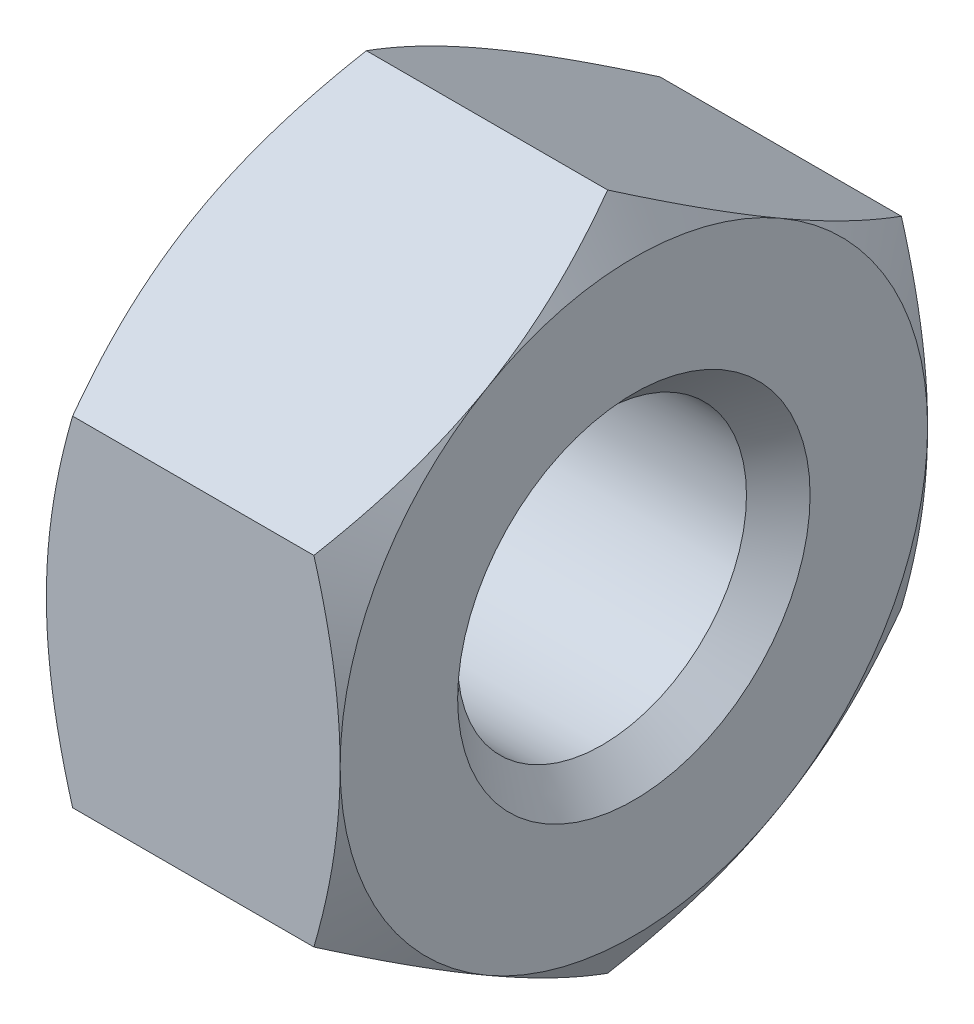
ISO-10303-21;
HEADER;
FILE_DESCRIPTION(('STEP AP214'),'2;1');
FILE_NAME('part.step','',(''),(''),'','','');
FILE_SCHEMA(('AUTOMOTIVE_DESIGN { 1 0 10303 214 1 1 1 1 }'));
ENDSEC;
DATA;
#1=APPLICATION_CONTEXT('core data for automotive mechanical design processes');
#2=APPLICATION_PROTOCOL_DEFINITION('international standard','automotive_design',2000,#1);
#3=PRODUCT_CONTEXT('',#1,'mechanical');
#4=PRODUCT('Part','Part','',(#3));
#5=PRODUCT_RELATED_PRODUCT_CATEGORY('part','',(#4));
#6=PRODUCT_DEFINITION_FORMATION('','',#4);
#7=PRODUCT_DEFINITION_CONTEXT('part definition',#1,'design');
#8=PRODUCT_DEFINITION('design','',#6,#7);
#9=PRODUCT_DEFINITION_SHAPE('','',#8);
#10=(LENGTH_UNIT() NAMED_UNIT(*) SI_UNIT(.MILLI.,.METRE.));
#11=(NAMED_UNIT(*) PLANE_ANGLE_UNIT() SI_UNIT($,.RADIAN.));
#12=(NAMED_UNIT(*) SI_UNIT($,.STERADIAN.) SOLID_ANGLE_UNIT());
#13=UNCERTAINTY_MEASURE_WITH_UNIT(LENGTH_MEASURE(1.E-05),#10,'distance_accuracy_value','');
#14=(GEOMETRIC_REPRESENTATION_CONTEXT(3) GLOBAL_UNCERTAINTY_ASSIGNED_CONTEXT((#13)) GLOBAL_UNIT_ASSIGNED_CONTEXT((#10,
#11,#12)) REPRESENTATION_CONTEXT('',''));
#15=CARTESIAN_POINT('',(0.,0.,0.));
#16=DIRECTION('',(0.,0.,1.));
#17=DIRECTION('',(1.,0.,0.));
#18=AXIS2_PLACEMENT_3D('',#15,#16,#17);
#19=CARTESIAN_POINT('',(0.577350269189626,0.,0.));
#20=DIRECTION('',(1.,0.,0.));
#21=DIRECTION('',(0.,0.,-1.));
#22=AXIS2_PLACEMENT_3D('',#19,#20,#21);
#23=CONICAL_SURFACE('',#22,6.,1.0471975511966);
#24=CARTESIAN_POINT('',(0.446648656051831,-2.88663587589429,-5.0002));
#25=CARTESIAN_POINT('',(0.373386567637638,-3.01349970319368,-4.78046540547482));
#26=CARTESIAN_POINT('',(0.306751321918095,-3.14144859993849,-4.55885141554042));
#27=CARTESIAN_POINT('',(0.190438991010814,-3.39956193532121,-4.11178600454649));
#28=CARTESIAN_POINT('',(0.140803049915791,-3.52973095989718,-3.88632664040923));
#29=CARTESIAN_POINT('',(0.0635510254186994,-3.78847564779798,-3.43816769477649));
#30=CARTESIAN_POINT('',(0.0354203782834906,-3.91701101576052,-3.21553790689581));
#31=CARTESIAN_POINT('',(0.0101949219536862,-4.11026620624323,-2.88081009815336));
#32=CARTESIAN_POINT('',(0.00461345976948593,-4.17472868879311,-2.76915780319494));
#33=CARTESIAN_POINT('',(-0.000797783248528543,-4.30371322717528,-2.5457500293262));
#34=CARTESIAN_POINT('',(-0.000627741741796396,-4.36823528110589,-2.43399455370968));
#35=CARTESIAN_POINT('',(0.0077536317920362,-4.54500768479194,-2.12781576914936));
#36=CARTESIAN_POINT('',(0.0218297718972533,-4.65719946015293,-1.93349391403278));
#37=CARTESIAN_POINT('',(0.0664652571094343,-4.88083840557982,-1.54613989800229));
#38=CARTESIAN_POINT('',(0.0970398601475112,-4.99228478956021,-1.35310909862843));
#39=CARTESIAN_POINT('',(0.173468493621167,-5.21637431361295,-0.964974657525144));
#40=CARTESIAN_POINT('',(0.219646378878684,-5.32898917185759,-0.769920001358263));
#41=CARTESIAN_POINT('',(0.324451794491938,-5.55253939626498,-0.382719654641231));
#42=CARTESIAN_POINT('',(0.383054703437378,-5.66347762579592,-0.190569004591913));
#43=CARTESIAN_POINT('',(0.446648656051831,-5.7736181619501,0.000200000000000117));
#44=B_SPLINE_CURVE_WITH_KNOTS('',3,(#24,#25,#26,#27,#28,#29,#30,#31,#32,#33,#34,#35,#36,#37,#38,
#39,#40,#41,#42,#43),.UNSPECIFIED.,.F.,.F.,(4,2,2,2,2,2,2,2,2,4),(0.,0.792555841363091,
1.58701660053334,2.36181537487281,2.74884076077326,3.13585419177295,3.8096236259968,
4.4840172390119,5.17336882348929,5.86136694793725),.UNSPECIFIED.);
#45=CARTESIAN_POINT('',(0.,-4.3301270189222,-2.5));
#46=VERTEX_POINT('',#45);
#47=CARTESIAN_POINT('',(0.446581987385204,-5.77350269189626,0.));
#48=VERTEX_POINT('',#47);
#49=EDGE_CURVE('E274',#46,#48,#44,.T.);
#50=ORIENTED_EDGE('',*,*,#49,.T.);
#51=CARTESIAN_POINT('',(0.446648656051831,-5.77361816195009,-0.0002));
#52=CARTESIAN_POINT('',(0.373386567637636,-5.6467543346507,0.219534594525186));
#53=CARTESIAN_POINT('',(0.306751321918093,-5.51880543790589,0.441148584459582));
#54=CARTESIAN_POINT('',(0.190438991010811,-5.26069210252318,0.888213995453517));
#55=CARTESIAN_POINT('',(0.140803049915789,-5.13052307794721,1.11367335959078));
#56=CARTESIAN_POINT('',(0.0635510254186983,-4.87177839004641,1.56183230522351));
#57=CARTESIAN_POINT('',(0.0354203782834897,-4.74324302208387,1.7844620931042));
#58=CARTESIAN_POINT('',(0.0101949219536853,-4.54998783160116,2.11918990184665));
#59=CARTESIAN_POINT('',(0.00461345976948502,-4.48552534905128,2.23084219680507));
#60=CARTESIAN_POINT('',(-0.000797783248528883,-4.35654081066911,2.4542499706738));
#61=CARTESIAN_POINT('',(-0.000627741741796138,-4.2920187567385,2.56600544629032));
#62=CARTESIAN_POINT('',(0.00775363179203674,-4.11524635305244,2.87218423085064));
#63=CARTESIAN_POINT('',(0.0218297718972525,-4.00305457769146,3.06650608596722));
#64=CARTESIAN_POINT('',(0.0664652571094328,-3.77941563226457,3.45386010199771));
#65=CARTESIAN_POINT('',(0.0970398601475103,-3.66796924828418,3.64689090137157));
#66=CARTESIAN_POINT('',(0.173468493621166,-3.44387972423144,4.03502534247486));
#67=CARTESIAN_POINT('',(0.219646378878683,-3.3312648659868,4.23007999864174));
#68=CARTESIAN_POINT('',(0.324451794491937,-3.1077146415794,4.61728034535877));
#69=CARTESIAN_POINT('',(0.383054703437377,-2.99677641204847,4.80943099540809));
#70=CARTESIAN_POINT('',(0.446648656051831,-2.88663587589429,5.0002));
#71=B_SPLINE_CURVE_WITH_KNOTS('',3,(#51,#52,#53,#54,#55,#56,#57,#58,#59,#60,#61,#62,#63,#64,#65,
#66,#67,#68,#69,#70),.UNSPECIFIED.,.F.,.F.,(4,2,2,2,2,2,2,2,2,4),(0.,0.792555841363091,
1.58701660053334,2.36181537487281,2.74884076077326,3.13585419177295,3.80962362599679,
4.48401723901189,5.17336882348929,5.86136694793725),.UNSPECIFIED.);
#72=CARTESIAN_POINT('',(0.,-4.3301270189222,2.5));
#73=VERTEX_POINT('',#72);
#74=EDGE_CURVE('E222',#48,#73,#71,.T.);
#75=ORIENTED_EDGE('',*,*,#74,.T.);
#76=CARTESIAN_POINT('',(0.,0.,0.));
#77=DIRECTION('',(-1.,0.,0.));
#78=DIRECTION('',(0.,0.,1.));
#79=AXIS2_PLACEMENT_3D('',#76,#77,#78);
#80=CIRCLE('',#79,5.);
#81=EDGE_CURVE('E252',#46,#73,#80,.T.);
#82=ORIENTED_EDGE('',*,*,#81,.F.);
#83=EDGE_LOOP('',(#50,#75,#82));
#84=FACE_BOUND('',#83,.T.);
#85=ADVANCED_FACE('F16',(#84),#23,.T.);
#86=CARTESIAN_POINT('',(0.,0.,5.));
#87=VERTEX_POINT('',#86);
#88=EDGE_CURVE('E25',#73,#87,#80,.T.);
#89=ORIENTED_EDGE('',*,*,#88,.F.);
#90=CARTESIAN_POINT('',(0.446581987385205,-2.88675134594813,5.));
#91=VERTEX_POINT('',#90);
#92=EDGE_CURVE('E223',#73,#91,#71,.T.);
#93=ORIENTED_EDGE('',*,*,#92,.T.);
#94=CARTESIAN_POINT('',(2.40141155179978,-7.67424266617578,5.));
#95=CARTESIAN_POINT('',(2.29611929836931,-7.45651756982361,5.));
#96=CARTESIAN_POINT('',(2.19186004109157,-7.23828398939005,5.));
#97=CARTESIAN_POINT('',(1.98599017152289,-6.80052913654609,5.));
#98=CARTESIAN_POINT('',(1.88437999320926,-6.5810076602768,5.));
#99=CARTESIAN_POINT('',(1.68386247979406,-6.13923637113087,5.));
#100=CARTESIAN_POINT('',(1.58497359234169,-5.91697815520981,5.));
#101=CARTESIAN_POINT('',(1.39135100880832,-5.47066571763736,5.));
#102=CARTESIAN_POINT('',(1.29661711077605,-5.24661158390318,5.));
#103=CARTESIAN_POINT('',(1.1095741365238,-4.78943363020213,5.));
#104=CARTESIAN_POINT('',(1.01742869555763,-4.55624248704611,5.));
#105=CARTESIAN_POINT('',(0.840307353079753,-4.08710259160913,5.));
#106=CARTESIAN_POINT('',(0.755332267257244,-3.8511535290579,5.));
#107=CARTESIAN_POINT('',(0.594841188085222,-3.37659063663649,5.));
#108=CARTESIAN_POINT('',(0.519305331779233,-3.13798359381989,5.));
#109=CARTESIAN_POINT('',(0.38016913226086,-2.65734835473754,5.));
#110=CARTESIAN_POINT('',(0.316564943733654,-2.41532128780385,5.));
#111=CARTESIAN_POINT('',(0.204730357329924,-1.92903682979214,5.));
#112=CARTESIAN_POINT('',(0.156419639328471,-1.68479826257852,5.));
#113=CARTESIAN_POINT('',(0.0779572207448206,-1.19336958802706,5.));
#114=CARTESIAN_POINT('',(0.0478039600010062,-0.946179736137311,5.));
#115=CARTESIAN_POINT('',(0.00845800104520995,-0.45327703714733,5.));
#116=CARTESIAN_POINT('',(-0.000997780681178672,-0.207585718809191,5.));
#117=CARTESIAN_POINT('',(0.00116511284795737,0.283721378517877,5.));
#118=CARTESIAN_POINT('',(0.0127843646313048,0.529337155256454,5.));
#119=CARTESIAN_POINT('',(0.0498085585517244,0.948737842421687,5.));
#120=CARTESIAN_POINT('',(0.0703212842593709,1.12297901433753,5.));
#121=CARTESIAN_POINT('',(0.120631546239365,1.47012511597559,5.));
#122=CARTESIAN_POINT('',(0.150430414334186,1.64302985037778,5.));
#123=CARTESIAN_POINT('',(0.252183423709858,2.15954369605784,5.));
#124=CARTESIAN_POINT('',(0.336473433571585,2.50074645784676,5.));
#125=CARTESIAN_POINT('',(0.481857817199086,3.01082734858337,5.));
#126=CARTESIAN_POINT('',(0.53413391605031,3.18236868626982,5.));
#127=CARTESIAN_POINT('',(0.643921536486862,3.52378385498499,5.));
#128=CARTESIAN_POINT('',(0.701433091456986,3.69365767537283,5.));
#129=CARTESIAN_POINT('',(0.820784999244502,4.03179540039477,5.));
#130=CARTESIAN_POINT('',(0.882623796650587,4.20005985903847,5.));
#131=CARTESIAN_POINT('',(1.00992212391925,4.53520796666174,5.));
#132=CARTESIAN_POINT('',(1.0753816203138,4.70209162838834,5.));
#133=CARTESIAN_POINT('',(1.22797114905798,5.08094953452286,5.));
#134=CARTESIAN_POINT('',(1.31605908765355,5.29253714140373,5.));
#135=CARTESIAN_POINT('',(1.49617433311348,5.71403334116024,5.));
#136=CARTESIAN_POINT('',(1.58820183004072,5.92394185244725,5.));
#137=CARTESIAN_POINT('',(1.77544370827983,6.34237109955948,5.));
#138=CARTESIAN_POINT('',(1.87065861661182,6.55089159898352,5.));
#139=CARTESIAN_POINT('',(2.06367410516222,6.9667341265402,5.));
#140=CARTESIAN_POINT('',(2.16147473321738,7.17405613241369,5.));
#141=CARTESIAN_POINT('',(2.45820681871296,7.79486538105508,5.));
#142=CARTESIAN_POINT('',(2.6603061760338,8.20683771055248,5.));
#143=CARTESIAN_POINT('',(3.07032550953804,9.02787503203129,5.));
#144=CARTESIAN_POINT('',(3.27824567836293,9.43693992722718,5.));
#145=CARTESIAN_POINT('',(3.5850921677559,10.0330186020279,5.));
#146=CARTESIAN_POINT('',(3.68236601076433,10.220885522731,5.));
#147=CARTESIAN_POINT('',(3.87769156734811,10.596210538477,5.));
#148=CARTESIAN_POINT('',(3.97574326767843,10.7836686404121,5.));
#149=CARTESIAN_POINT('',(4.2709190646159,11.3455237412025,5.));
#150=CARTESIAN_POINT('',(4.46905696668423,11.7193881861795,5.));
#151=CARTESIAN_POINT('',(4.86697004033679,12.4651867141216,5.));
#152=CARTESIAN_POINT('',(5.0667406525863,12.837123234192,5.));
#153=CARTESIAN_POINT('',(5.46792402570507,13.5800864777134,5.));
#154=CARTESIAN_POINT('',(5.66933670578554,13.9511132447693,5.));
#155=CARTESIAN_POINT('',(5.87136819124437,14.3218006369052,5.));
#156=B_SPLINE_CURVE_WITH_KNOTS('',3,(#94,#95,#96,#97,#98,#99,#100,#101,#102,#103,#104,#105,#106,
#107,#108,#109,#110,#111,#112,#113,#114,#115,#116,#117,#118,#119,#120,#121,#122,#123,#124,#125,
#126,#127,#128,#129,#130,#131,#132,#133,#134,#135,#136,#137,#138,#139,#140,#141,#142,#143,#144,
#145,#146,#147,#148,#149,#150,#151,#152,#153,#154,#155),.UNSPECIFIED.,.F.,.F.,(4,2,2,2,2,2,2,2,
2,2,2,2,2,2,2,2,2,2,2,2,2,2,2,2,2,2,2,2,2,2,4),(0.,0.725554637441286,1.45122739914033,
2.18098756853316,2.91071222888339,3.66283124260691,4.41503570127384,5.16562964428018,
5.91598127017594,6.66232408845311,7.40860276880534,8.14533911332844,8.8820956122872,
9.40817218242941,9.93432423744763,10.9872465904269,11.5251934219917,12.0631436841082,
12.6009015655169,13.1386544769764,13.8261771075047,14.5137329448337,15.2014030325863,
15.8890858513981,17.2656308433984,18.642221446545,19.2768896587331,19.9115470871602,
21.1809070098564,22.4474751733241,23.7139813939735),.UNSPECIFIED.);
#157=EDGE_CURVE('E232',#91,#87,#156,.T.);
#158=ORIENTED_EDGE('',*,*,#157,.T.);
#159=EDGE_LOOP('',(#89,#93,#158));
#160=FACE_BOUND('',#159,.T.);
#161=ADVANCED_FACE('F310',(#160),#23,.T.);
#162=CARTESIAN_POINT('',(0.,4.3301270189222,2.5));
#163=VERTEX_POINT('',#162);
#164=EDGE_CURVE('E11',#87,#163,#80,.T.);
#165=ORIENTED_EDGE('',*,*,#164,.F.);
#166=CARTESIAN_POINT('',(0.446581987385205,2.88675134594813,5.));
#167=VERTEX_POINT('',#166);
#168=EDGE_CURVE('E135',#87,#167,#156,.T.);
#169=ORIENTED_EDGE('',*,*,#168,.T.);
#170=CARTESIAN_POINT('',(0.446648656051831,2.88663587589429,5.0002));
#171=CARTESIAN_POINT('',(0.373386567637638,3.01349970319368,4.78046540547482));
#172=CARTESIAN_POINT('',(0.306751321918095,3.14144859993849,4.55885141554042));
#173=CARTESIAN_POINT('',(0.190438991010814,3.39956193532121,4.11178600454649));
#174=CARTESIAN_POINT('',(0.140803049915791,3.52973095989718,3.88632664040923));
#175=CARTESIAN_POINT('',(0.0635510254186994,3.78847564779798,3.43816769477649));
#176=CARTESIAN_POINT('',(0.0354203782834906,3.91701101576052,3.21553790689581));
#177=CARTESIAN_POINT('',(0.0101949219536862,4.11026620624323,2.88081009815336));
#178=CARTESIAN_POINT('',(0.00461345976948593,4.17472868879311,2.76915780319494));
#179=CARTESIAN_POINT('',(-0.000797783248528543,4.30371322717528,2.5457500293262));
#180=CARTESIAN_POINT('',(-0.000627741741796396,4.36823528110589,2.43399455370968));
#181=CARTESIAN_POINT('',(0.0077536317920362,4.54500768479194,2.12781576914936));
#182=CARTESIAN_POINT('',(0.0218297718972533,4.65719946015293,1.93349391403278));
#183=CARTESIAN_POINT('',(0.0664652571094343,4.88083840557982,1.54613989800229));
#184=CARTESIAN_POINT('',(0.0970398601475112,4.99228478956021,1.35310909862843));
#185=CARTESIAN_POINT('',(0.173468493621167,5.21637431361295,0.964974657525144));
#186=CARTESIAN_POINT('',(0.219646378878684,5.32898917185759,0.769920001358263));
#187=CARTESIAN_POINT('',(0.324451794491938,5.55253939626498,0.382719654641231));
#188=CARTESIAN_POINT('',(0.383054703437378,5.66347762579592,0.190569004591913));
#189=CARTESIAN_POINT('',(0.446648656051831,5.7736181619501,-0.000200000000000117));
#190=B_SPLINE_CURVE_WITH_KNOTS('',3,(#170,#171,#172,#173,#174,#175,#176,#177,#178,#179,#180,
#181,#182,#183,#184,#185,#186,#187,#188,#189),.UNSPECIFIED.,.F.,.F.,(4,2,2,2,2,2,2,2,2,4),(0.,
0.792555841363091,1.58701660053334,2.36181537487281,2.74884076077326,3.13585419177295,
3.8096236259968,4.4840172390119,5.17336882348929,5.86136694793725),.UNSPECIFIED.);
#191=EDGE_CURVE('E136',#167,#163,#190,.T.);
#192=ORIENTED_EDGE('',*,*,#191,.T.);
#193=EDGE_LOOP('',(#165,#169,#192));
#194=FACE_BOUND('',#193,.T.);
#195=ADVANCED_FACE('F134',(#194),#23,.T.);
#196=CARTESIAN_POINT('',(2.40141155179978,-7.67424266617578,-5.));
#197=CARTESIAN_POINT('',(2.29611929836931,-7.45651756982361,-5.));
#198=CARTESIAN_POINT('',(2.19186004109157,-7.23828398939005,-5.));
#199=CARTESIAN_POINT('',(1.98599017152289,-6.80052913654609,-5.));
#200=CARTESIAN_POINT('',(1.88437999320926,-6.5810076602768,-5.));
#201=CARTESIAN_POINT('',(1.68386247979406,-6.13923637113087,-5.));
#202=CARTESIAN_POINT('',(1.58497359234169,-5.91697815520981,-5.));
#203=CARTESIAN_POINT('',(1.39135100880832,-5.47066571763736,-5.));
#204=CARTESIAN_POINT('',(1.29661711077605,-5.24661158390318,-5.));
#205=CARTESIAN_POINT('',(1.1095741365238,-4.78943363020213,-5.));
#206=CARTESIAN_POINT('',(1.01742869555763,-4.55624248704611,-5.));
#207=CARTESIAN_POINT('',(0.840307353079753,-4.08710259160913,-5.));
#208=CARTESIAN_POINT('',(0.755332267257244,-3.8511535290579,-5.));
#209=CARTESIAN_POINT('',(0.594841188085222,-3.37659063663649,-5.));
#210=CARTESIAN_POINT('',(0.519305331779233,-3.13798359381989,-5.));
#211=CARTESIAN_POINT('',(0.38016913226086,-2.65734835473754,-5.));
#212=CARTESIAN_POINT('',(0.316564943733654,-2.41532128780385,-5.));
#213=CARTESIAN_POINT('',(0.204730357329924,-1.92903682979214,-5.));
#214=CARTESIAN_POINT('',(0.156419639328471,-1.68479826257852,-5.));
#215=CARTESIAN_POINT('',(0.0779572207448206,-1.19336958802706,-5.));
#216=CARTESIAN_POINT('',(0.0478039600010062,-0.946179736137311,-5.));
#217=CARTESIAN_POINT('',(0.00845800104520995,-0.45327703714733,-5.));
#218=CARTESIAN_POINT('',(-0.000997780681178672,-0.207585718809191,-5.));
#219=CARTESIAN_POINT('',(0.00116511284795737,0.283721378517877,-5.));
#220=CARTESIAN_POINT('',(0.0127843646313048,0.529337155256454,-5.));
#221=CARTESIAN_POINT('',(0.0498085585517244,0.948737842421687,-5.));
#222=CARTESIAN_POINT('',(0.0703212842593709,1.12297901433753,-5.));
#223=CARTESIAN_POINT('',(0.120631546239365,1.47012511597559,-5.));
#224=CARTESIAN_POINT('',(0.150430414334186,1.64302985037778,-5.));
#225=CARTESIAN_POINT('',(0.252183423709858,2.15954369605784,-5.));
#226=CARTESIAN_POINT('',(0.336473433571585,2.50074645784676,-5.));
#227=CARTESIAN_POINT('',(0.481857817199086,3.01082734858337,-5.));
#228=CARTESIAN_POINT('',(0.53413391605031,3.18236868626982,-5.));
#229=CARTESIAN_POINT('',(0.643921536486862,3.52378385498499,-5.));
#230=CARTESIAN_POINT('',(0.701433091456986,3.69365767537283,-5.));
#231=CARTESIAN_POINT('',(0.820784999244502,4.03179540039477,-5.));
#232=CARTESIAN_POINT('',(0.882623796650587,4.20005985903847,-5.));
#233=CARTESIAN_POINT('',(1.00992212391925,4.53520796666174,-5.));
#234=CARTESIAN_POINT('',(1.0753816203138,4.70209162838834,-5.));
#235=CARTESIAN_POINT('',(1.22797114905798,5.08094953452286,-5.));
#236=CARTESIAN_POINT('',(1.31605908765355,5.29253714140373,-5.));
#237=CARTESIAN_POINT('',(1.49617433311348,5.71403334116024,-5.));
#238=CARTESIAN_POINT('',(1.58820183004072,5.92394185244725,-5.));
#239=CARTESIAN_POINT('',(1.77544370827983,6.34237109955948,-5.));
#240=CARTESIAN_POINT('',(1.87065861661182,6.55089159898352,-5.));
#241=CARTESIAN_POINT('',(2.06367410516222,6.9667341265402,-5.));
#242=CARTESIAN_POINT('',(2.16147473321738,7.17405613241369,-5.));
#243=CARTESIAN_POINT('',(2.45820681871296,7.79486538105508,-5.));
#244=CARTESIAN_POINT('',(2.6603061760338,8.20683771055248,-5.));
#245=CARTESIAN_POINT('',(3.07032550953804,9.02787503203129,-5.));
#246=CARTESIAN_POINT('',(3.27824567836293,9.43693992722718,-5.));
#247=CARTESIAN_POINT('',(3.5850921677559,10.0330186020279,-5.));
#248=CARTESIAN_POINT('',(3.68236601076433,10.220885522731,-5.));
#249=CARTESIAN_POINT('',(3.87769156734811,10.596210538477,-5.));
#250=CARTESIAN_POINT('',(3.97574326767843,10.7836686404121,-5.));
#251=CARTESIAN_POINT('',(4.2709190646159,11.3455237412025,-5.));
#252=CARTESIAN_POINT('',(4.46905696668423,11.7193881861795,-5.));
#253=CARTESIAN_POINT('',(4.86697004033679,12.4651867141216,-5.));
#254=CARTESIAN_POINT('',(5.0667406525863,12.837123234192,-5.));
#255=CARTESIAN_POINT('',(5.46792402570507,13.5800864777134,-5.));
#256=CARTESIAN_POINT('',(5.66933670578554,13.9511132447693,-5.));
#257=CARTESIAN_POINT('',(5.87136819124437,14.3218006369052,-5.));
#258=B_SPLINE_CURVE_WITH_KNOTS('',3,(#196,#197,#198,#199,#200,#201,#202,#203,#204,#205,#206,
#207,#208,#209,#210,#211,#212,#213,#214,#215,#216,#217,#218,#219,#220,#221,#222,#223,#224,#225,
#226,#227,#228,#229,#230,#231,#232,#233,#234,#235,#236,#237,#238,#239,#240,#241,#242,#243,#244,
#245,#246,#247,#248,#249,#250,#251,#252,#253,#254,#255,#256,#257),.UNSPECIFIED.,.F.,.F.,(4,2,2,
2,2,2,2,2,2,2,2,2,2,2,2,2,2,2,2,2,2,2,2,2,2,2,2,2,2,2,4),(0.,0.725554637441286,1.45122739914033,
2.18098756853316,2.91071222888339,3.66283124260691,4.41503570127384,5.16562964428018,
5.91598127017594,6.66232408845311,7.40860276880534,8.14533911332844,8.8820956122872,
9.40817218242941,9.93432423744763,10.9872465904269,11.5251934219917,12.0631436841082,
12.6009015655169,13.1386544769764,13.8261771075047,14.5137329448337,15.2014030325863,
15.8890858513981,17.2656308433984,18.642221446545,19.2768896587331,19.9115470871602,
21.1809070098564,22.4474751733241,23.7139813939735),.UNSPECIFIED.);
#259=CARTESIAN_POINT('',(0.,0.,-5.));
#260=VERTEX_POINT('',#259);
#261=CARTESIAN_POINT('',(0.446581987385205,-2.88675134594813,-5.));
#262=VERTEX_POINT('',#261);
#263=EDGE_CURVE('E277',#260,#262,#258,.F.);
#264=ORIENTED_EDGE('',*,*,#263,.T.);
#265=EDGE_CURVE('E276',#262,#46,#44,.T.);
#266=ORIENTED_EDGE('',*,*,#265,.T.);
#267=EDGE_CURVE('E126',#260,#46,#80,.T.);
#268=ORIENTED_EDGE('',*,*,#267,.F.);
#269=EDGE_LOOP('',(#264,#266,#268));
#270=FACE_BOUND('',#269,.T.);
#271=ADVANCED_FACE('F324',(#270),#23,.T.);
#272=CARTESIAN_POINT('',(0.,4.3301270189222,-2.5));
#273=VERTEX_POINT('',#272);
#274=EDGE_CURVE('E24',#163,#273,#80,.T.);
#275=ORIENTED_EDGE('',*,*,#274,.F.);
#276=CARTESIAN_POINT('',(0.446581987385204,5.77350269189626,0.));
#277=VERTEX_POINT('',#276);
#278=EDGE_CURVE('E117',#163,#277,#190,.T.);
#279=ORIENTED_EDGE('',*,*,#278,.T.);
#280=CARTESIAN_POINT('',(0.446648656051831,5.77361816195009,0.0002));
#281=CARTESIAN_POINT('',(0.373386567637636,5.6467543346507,-0.219534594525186));
#282=CARTESIAN_POINT('',(0.306751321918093,5.51880543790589,-0.441148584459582));
#283=CARTESIAN_POINT('',(0.190438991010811,5.26069210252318,-0.888213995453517));
#284=CARTESIAN_POINT('',(0.140803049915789,5.13052307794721,-1.11367335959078));
#285=CARTESIAN_POINT('',(0.0635510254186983,4.87177839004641,-1.56183230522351));
#286=CARTESIAN_POINT('',(0.0354203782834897,4.74324302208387,-1.7844620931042));
#287=CARTESIAN_POINT('',(0.0101949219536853,4.54998783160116,-2.11918990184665));
#288=CARTESIAN_POINT('',(0.00461345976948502,4.48552534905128,-2.23084219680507));
#289=CARTESIAN_POINT('',(-0.000797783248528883,4.35654081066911,-2.4542499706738));
#290=CARTESIAN_POINT('',(-0.000627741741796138,4.2920187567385,-2.56600544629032));
#291=CARTESIAN_POINT('',(0.00775363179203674,4.11524635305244,-2.87218423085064));
#292=CARTESIAN_POINT('',(0.0218297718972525,4.00305457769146,-3.06650608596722));
#293=CARTESIAN_POINT('',(0.0664652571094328,3.77941563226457,-3.45386010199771));
#294=CARTESIAN_POINT('',(0.0970398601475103,3.66796924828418,-3.64689090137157));
#295=CARTESIAN_POINT('',(0.173468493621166,3.44387972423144,-4.03502534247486));
#296=CARTESIAN_POINT('',(0.219646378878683,3.3312648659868,-4.23007999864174));
#297=CARTESIAN_POINT('',(0.324451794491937,3.1077146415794,-4.61728034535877));
#298=CARTESIAN_POINT('',(0.383054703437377,2.99677641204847,-4.80943099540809));
#299=CARTESIAN_POINT('',(0.446648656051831,2.88663587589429,-5.0002));
#300=B_SPLINE_CURVE_WITH_KNOTS('',3,(#280,#281,#282,#283,#284,#285,#286,#287,#288,#289,#290,
#291,#292,#293,#294,#295,#296,#297,#298,#299),.UNSPECIFIED.,.F.,.F.,(4,2,2,2,2,2,2,2,2,4),(0.,
0.792555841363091,1.58701660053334,2.36181537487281,2.74884076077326,3.13585419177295,
3.80962362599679,4.48401723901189,5.17336882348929,5.86136694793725),.UNSPECIFIED.);
#301=EDGE_CURVE('E106',#277,#273,#300,.T.);
#302=ORIENTED_EDGE('',*,*,#301,.T.);
#303=EDGE_LOOP('',(#275,#279,#302));
#304=FACE_BOUND('',#303,.T.);
#305=ADVANCED_FACE('F115',(#304),#23,.T.);
#306=CARTESIAN_POINT('',(0.,0.,0.));
#307=DIRECTION('',(1.,0.,0.));
#308=DIRECTION('',(0.,0.,-1.));
#309=AXIS2_PLACEMENT_3D('',#306,#307,#308);
#310=PLANE('',#309);
#311=CARTESIAN_POINT('',(0.,0.,0.));
#312=DIRECTION('',(-1.,0.,0.));
#313=DIRECTION('',(0.,0.,1.));
#314=AXIS2_PLACEMENT_3D('',#311,#312,#313);
#315=CIRCLE('',#314,3.);
#316=CARTESIAN_POINT('',(0.,0.,3.));
#317=VERTEX_POINT('',#316);
#318=EDGE_CURVE('E401',#317,#317,#315,.T.);
#319=ORIENTED_EDGE('',*,*,#318,.F.);
#320=EDGE_LOOP('',(#319));
#321=FACE_BOUND('',#320,.T.);
#322=ORIENTED_EDGE('',*,*,#164,.T.);
#323=ORIENTED_EDGE('',*,*,#274,.T.);
#324=EDGE_CURVE('E120',#273,#260,#80,.T.);
#325=ORIENTED_EDGE('',*,*,#324,.T.);
#326=ORIENTED_EDGE('',*,*,#267,.T.);
#327=ORIENTED_EDGE('',*,*,#81,.T.);
#328=ORIENTED_EDGE('',*,*,#88,.T.);
#329=EDGE_LOOP('',(#322,#323,#325,#326,#327,#328));
#330=FACE_BOUND('',#329,.T.);
#331=ADVANCED_FACE('F18',(#321,#330),#310,.F.);
#332=CARTESIAN_POINT('',(0.446581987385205,2.88675134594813,-5.));
#333=VERTEX_POINT('',#332);
#334=EDGE_CURVE('E103',#273,#333,#300,.T.);
#335=ORIENTED_EDGE('',*,*,#334,.T.);
#336=EDGE_CURVE('E122',#333,#260,#258,.F.);
#337=ORIENTED_EDGE('',*,*,#336,.T.);
#338=ORIENTED_EDGE('',*,*,#324,.F.);
#339=EDGE_LOOP('',(#335,#337,#338));
#340=FACE_BOUND('',#339,.T.);
#341=ADVANCED_FACE('F121',(#340),#23,.T.);
#342=CARTESIAN_POINT('',(10.,5.77350269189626,0.));
#343=DIRECTION('',(0.,-0.866025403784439,-0.5));
#344=DIRECTION('',(0.,0.5,-0.866025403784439));
#345=AXIS2_PLACEMENT_3D('',#342,#343,#344);
#346=PLANE('',#345);
#347=DIRECTION('',(-1.,0.,0.));
#348=VECTOR('',#347,1.);
#349=CARTESIAN_POINT('',(10.,2.88675134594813,5.));
#350=LINE('',#349,#348);
#351=CARTESIAN_POINT('',(4.5534180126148,2.88675134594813,5.));
#352=VERTEX_POINT('',#351);
#353=EDGE_CURVE('E347',#352,#167,#350,.T.);
#354=ORIENTED_EDGE('',*,*,#353,.F.);
#355=CARTESIAN_POINT('',(4.55335134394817,5.7736181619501,-0.0002));
#356=CARTESIAN_POINT('',(4.62661343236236,5.64675433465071,0.219534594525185));
#357=CARTESIAN_POINT('',(4.69324867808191,5.5188054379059,0.441148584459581));
#358=CARTESIAN_POINT('',(4.80956100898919,5.26069210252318,0.888213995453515));
#359=CARTESIAN_POINT('',(4.85919695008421,5.13052307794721,1.11367335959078));
#360=CARTESIAN_POINT('',(4.9364489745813,4.87177839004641,1.56183230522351));
#361=CARTESIAN_POINT('',(4.96457962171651,4.74324302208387,1.7844620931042));
#362=CARTESIAN_POINT('',(4.98980507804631,4.54998783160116,2.11918990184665));
#363=CARTESIAN_POINT('',(4.99538654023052,4.48552534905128,2.23084219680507));
#364=CARTESIAN_POINT('',(5.00079778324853,4.35654081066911,2.4542499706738));
#365=CARTESIAN_POINT('',(5.0006277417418,4.2920187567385,2.56600544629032));
#366=CARTESIAN_POINT('',(4.99224636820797,4.11524635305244,2.87218423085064));
#367=CARTESIAN_POINT('',(4.97817022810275,4.00305457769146,3.06650608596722));
#368=CARTESIAN_POINT('',(4.93353474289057,3.77941563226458,3.45386010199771));
#369=CARTESIAN_POINT('',(4.90296013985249,3.66796924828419,3.64689090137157));
#370=CARTESIAN_POINT('',(4.82653150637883,3.44387972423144,4.03502534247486));
#371=CARTESIAN_POINT('',(4.78035362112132,3.3312648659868,4.23007999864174));
#372=CARTESIAN_POINT('',(4.67554820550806,3.10771464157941,4.61728034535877));
#373=CARTESIAN_POINT('',(4.61694529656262,2.99677641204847,4.80943099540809));
#374=CARTESIAN_POINT('',(4.55335134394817,2.88663587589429,5.0002));
#375=B_SPLINE_CURVE_WITH_KNOTS('',3,(#355,#356,#357,#358,#359,#360,#361,#362,#363,#364,#365,
#366,#367,#368,#369,#370,#371,#372,#373,#374),.UNSPECIFIED.,.F.,.F.,(4,2,2,2,2,2,2,2,2,4),(0.,
0.792555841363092,1.58701660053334,2.36181537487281,2.74884076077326,3.13585419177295,
3.8096236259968,4.48401723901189,5.17336882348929,5.86136694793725),.UNSPECIFIED.);
#376=CARTESIAN_POINT('',(5.,4.3301270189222,2.5));
#377=VERTEX_POINT('',#376);
#378=EDGE_CURVE('E152',#377,#352,#375,.T.);
#379=ORIENTED_EDGE('',*,*,#378,.F.);
#380=CARTESIAN_POINT('',(4.5534180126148,5.77350269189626,0.));
#381=VERTEX_POINT('',#380);
#382=EDGE_CURVE('E145',#381,#377,#375,.T.);
#383=ORIENTED_EDGE('',*,*,#382,.F.);
#384=DIRECTION('',(-1.,0.,0.));
#385=VECTOR('',#384,1.);
#386=CARTESIAN_POINT('',(10.,5.77350269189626,0.));
#387=LINE('',#386,#385);
#388=EDGE_CURVE('E39',#381,#277,#387,.T.);
#389=ORIENTED_EDGE('',*,*,#388,.T.);
#390=ORIENTED_EDGE('',*,*,#278,.F.);
#391=ORIENTED_EDGE('',*,*,#191,.F.);
#392=EDGE_LOOP('',(#354,#379,#383,#389,#390,#391));
#393=FACE_BOUND('',#392,.T.);
#394=ADVANCED_FACE('F160',(#393),#346,.F.);
#395=CARTESIAN_POINT('',(10.,2.88675134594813,5.));
#396=DIRECTION('',(0.,0.,-1.));
#397=DIRECTION('',(-1.,0.,0.));
#398=AXIS2_PLACEMENT_3D('',#395,#396,#397);
#399=PLANE('',#398);
#400=DIRECTION('',(-1.,0.,0.));
#401=VECTOR('',#400,1.);
#402=CARTESIAN_POINT('',(10.,-2.88675134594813,5.));
#403=LINE('',#402,#401);
#404=CARTESIAN_POINT('',(4.5534180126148,-2.88675134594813,5.));
#405=VERTEX_POINT('',#404);
#406=EDGE_CURVE('E341',#405,#91,#403,.T.);
#407=ORIENTED_EDGE('',*,*,#406,.F.);
#408=CARTESIAN_POINT('',(2.59858844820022,-7.67424266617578,5.));
#409=CARTESIAN_POINT('',(2.7038807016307,-7.4565175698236,5.));
#410=CARTESIAN_POINT('',(2.80813995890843,-7.23828398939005,5.));
#411=CARTESIAN_POINT('',(3.01400982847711,-6.80052913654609,5.));
#412=CARTESIAN_POINT('',(3.11562000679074,-6.5810076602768,5.));
#413=CARTESIAN_POINT('',(3.31613752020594,-6.13923637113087,5.));
#414=CARTESIAN_POINT('',(3.41502640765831,-5.91697815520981,5.));
#415=CARTESIAN_POINT('',(3.60864899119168,-5.47066571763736,5.));
#416=CARTESIAN_POINT('',(3.70338288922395,-5.24661158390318,5.));
#417=CARTESIAN_POINT('',(3.8904258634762,-4.78943363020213,5.));
#418=CARTESIAN_POINT('',(3.98257130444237,-4.55624248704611,5.));
#419=CARTESIAN_POINT('',(4.15969264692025,-4.08710259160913,5.));
#420=CARTESIAN_POINT('',(4.24466773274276,-3.8511535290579,5.));
#421=CARTESIAN_POINT('',(4.40515881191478,-3.37659063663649,5.));
#422=CARTESIAN_POINT('',(4.48069466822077,-3.13798359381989,5.));
#423=CARTESIAN_POINT('',(4.61983086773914,-2.65734835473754,5.));
#424=CARTESIAN_POINT('',(4.68343505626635,-2.41532128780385,5.));
#425=CARTESIAN_POINT('',(4.79526964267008,-1.92903682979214,5.));
#426=CARTESIAN_POINT('',(4.84358036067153,-1.68479826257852,5.));
#427=CARTESIAN_POINT('',(4.92204277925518,-1.19336958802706,5.));
#428=CARTESIAN_POINT('',(4.95219603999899,-0.946179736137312,5.));
#429=CARTESIAN_POINT('',(4.99154199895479,-0.45327703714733,5.));
#430=CARTESIAN_POINT('',(5.00099778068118,-0.207585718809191,5.));
#431=CARTESIAN_POINT('',(4.99883488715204,0.283721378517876,5.));
#432=CARTESIAN_POINT('',(4.98721563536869,0.529337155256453,5.));
#433=CARTESIAN_POINT('',(4.95019144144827,0.948737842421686,5.));
#434=CARTESIAN_POINT('',(4.92967871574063,1.12297901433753,5.));
#435=CARTESIAN_POINT('',(4.87936845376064,1.47012511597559,5.));
#436=CARTESIAN_POINT('',(4.84956958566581,1.64302985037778,5.));
#437=CARTESIAN_POINT('',(4.74781657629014,2.15954369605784,5.));
#438=CARTESIAN_POINT('',(4.66352656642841,2.50074645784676,5.));
#439=CARTESIAN_POINT('',(4.51814218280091,3.01082734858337,5.));
#440=CARTESIAN_POINT('',(4.46586608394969,3.18236868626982,5.));
#441=CARTESIAN_POINT('',(4.35607846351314,3.52378385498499,5.));
#442=CARTESIAN_POINT('',(4.29856690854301,3.69365767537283,5.));
#443=CARTESIAN_POINT('',(4.1792150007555,4.03179540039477,5.));
#444=CARTESIAN_POINT('',(4.11737620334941,4.20005985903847,5.));
#445=CARTESIAN_POINT('',(3.99007787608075,4.53520796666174,5.));
#446=CARTESIAN_POINT('',(3.9246183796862,4.70209162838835,5.));
#447=CARTESIAN_POINT('',(3.77202885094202,5.08094953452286,5.));
#448=CARTESIAN_POINT('',(3.68394091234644,5.29253714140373,5.));
#449=CARTESIAN_POINT('',(3.50382566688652,5.71403334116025,5.));
#450=CARTESIAN_POINT('',(3.41179816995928,5.92394185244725,5.));
#451=CARTESIAN_POINT('',(3.22455629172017,6.34237109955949,5.));
#452=CARTESIAN_POINT('',(3.12934138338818,6.55089159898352,5.));
#453=CARTESIAN_POINT('',(2.93632589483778,6.96673412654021,5.));
#454=CARTESIAN_POINT('',(2.83852526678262,7.1740561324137,5.));
#455=CARTESIAN_POINT('',(2.54179318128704,7.79486538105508,5.));
#456=CARTESIAN_POINT('',(2.3396938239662,8.20683771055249,5.));
#457=CARTESIAN_POINT('',(1.92967449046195,9.02787503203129,5.));
#458=CARTESIAN_POINT('',(1.72175432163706,9.43693992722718,5.));
#459=CARTESIAN_POINT('',(1.4149078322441,10.033018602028,5.));
#460=CARTESIAN_POINT('',(1.31763398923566,10.220885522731,5.));
#461=CARTESIAN_POINT('',(1.12230843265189,10.596210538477,5.));
#462=CARTESIAN_POINT('',(1.02425673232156,10.7836686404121,5.));
#463=CARTESIAN_POINT('',(0.729080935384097,11.3455237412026,5.));
#464=CARTESIAN_POINT('',(0.530943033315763,11.7193881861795,5.));
#465=CARTESIAN_POINT('',(0.133029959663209,12.4651867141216,5.));
#466=CARTESIAN_POINT('',(-0.0667406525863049,12.837123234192,5.));
#467=CARTESIAN_POINT('',(-0.46792402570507,13.5800864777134,5.));
#468=CARTESIAN_POINT('',(-0.669336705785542,13.9511132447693,5.));
#469=CARTESIAN_POINT('',(-0.871368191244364,14.3218006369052,5.));
#470=B_SPLINE_CURVE_WITH_KNOTS('',3,(#408,#409,#410,#411,#412,#413,#414,#415,#416,#417,#418,
#419,#420,#421,#422,#423,#424,#425,#426,#427,#428,#429,#430,#431,#432,#433,#434,#435,#436,#437,
#438,#439,#440,#441,#442,#443,#444,#445,#446,#447,#448,#449,#450,#451,#452,#453,#454,#455,#456,
#457,#458,#459,#460,#461,#462,#463,#464,#465,#466,#467,#468,#469),.UNSPECIFIED.,.F.,.F.,(4,2,2,
2,2,2,2,2,2,2,2,2,2,2,2,2,2,2,2,2,2,2,2,2,2,2,2,2,2,2,4),(0.,0.725554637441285,1.45122739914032,
2.18098756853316,2.91071222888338,3.6628312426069,4.41503570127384,5.16562964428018,
5.91598127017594,6.66232408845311,7.40860276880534,8.14533911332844,8.88209561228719,
9.40817218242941,9.93432423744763,10.9872465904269,11.5251934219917,12.0631436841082,
12.6009015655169,13.1386544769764,13.8261771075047,14.5137329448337,15.2014030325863,
15.8890858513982,17.2656308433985,18.642221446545,19.2768896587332,19.9115470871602,
21.1809070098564,22.4474751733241,23.7139813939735),.UNSPECIFIED.);
#471=CARTESIAN_POINT('',(5.,0.,5.));
#472=VERTEX_POINT('',#471);
#473=EDGE_CURVE('E215',#472,#405,#470,.F.);
#474=ORIENTED_EDGE('',*,*,#473,.F.);
#475=EDGE_CURVE('E221',#352,#472,#470,.F.);
#476=ORIENTED_EDGE('',*,*,#475,.F.);
#477=ORIENTED_EDGE('',*,*,#353,.T.);
#478=ORIENTED_EDGE('',*,*,#168,.F.);
#479=ORIENTED_EDGE('',*,*,#157,.F.);
#480=EDGE_LOOP('',(#407,#474,#476,#477,#478,#479));
#481=FACE_BOUND('',#480,.T.);
#482=ADVANCED_FACE('F165',(#481),#399,.F.);
#483=CARTESIAN_POINT('',(10.,-2.88675134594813,5.));
#484=DIRECTION('',(0.,0.866025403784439,-0.5));
#485=DIRECTION('',(0.,0.5,0.866025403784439));
#486=AXIS2_PLACEMENT_3D('',#483,#484,#485);
#487=PLANE('',#486);
#488=DIRECTION('',(-1.,0.,0.));
#489=VECTOR('',#488,1.);
#490=CARTESIAN_POINT('',(10.,-5.77350269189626,0.));
#491=LINE('',#490,#489);
#492=CARTESIAN_POINT('',(4.5534180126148,-5.77350269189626,0.));
#493=VERTEX_POINT('',#492);
#494=EDGE_CURVE('E339',#493,#48,#491,.T.);
#495=ORIENTED_EDGE('',*,*,#494,.F.);
#496=CARTESIAN_POINT('',(4.55335134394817,-2.88663587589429,5.0002));
#497=CARTESIAN_POINT('',(4.62661343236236,-3.01349970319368,4.78046540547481));
#498=CARTESIAN_POINT('',(4.69324867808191,-3.14144859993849,4.55885141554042));
#499=CARTESIAN_POINT('',(4.80956100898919,-3.39956193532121,4.11178600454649));
#500=CARTESIAN_POINT('',(4.85919695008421,-3.52973095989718,3.88632664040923));
#501=CARTESIAN_POINT('',(4.9364489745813,-3.78847564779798,3.43816769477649));
#502=CARTESIAN_POINT('',(4.96457962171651,-3.91701101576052,3.2155379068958));
#503=CARTESIAN_POINT('',(4.98980507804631,-4.11026620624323,2.88081009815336));
#504=CARTESIAN_POINT('',(4.99538654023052,-4.17472868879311,2.76915780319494));
#505=CARTESIAN_POINT('',(5.00079778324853,-4.30371322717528,2.5457500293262));
#506=CARTESIAN_POINT('',(5.0006277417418,-4.36823528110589,2.43399455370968));
#507=CARTESIAN_POINT('',(4.99224636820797,-4.54500768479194,2.12781576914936));
#508=CARTESIAN_POINT('',(4.97817022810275,-4.65719946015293,1.93349391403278));
#509=CARTESIAN_POINT('',(4.93353474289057,-4.88083840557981,1.54613989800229));
#510=CARTESIAN_POINT('',(4.90296013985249,-4.9922847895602,1.35310909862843));
#511=CARTESIAN_POINT('',(4.82653150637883,-5.21637431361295,0.964974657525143));
#512=CARTESIAN_POINT('',(4.78035362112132,-5.32898917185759,0.769920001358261));
#513=CARTESIAN_POINT('',(4.67554820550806,-5.55253939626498,0.382719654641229));
#514=CARTESIAN_POINT('',(4.61694529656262,-5.66347762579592,0.190569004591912));
#515=CARTESIAN_POINT('',(4.55335134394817,-5.7736181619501,-0.000200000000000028));
#516=B_SPLINE_CURVE_WITH_KNOTS('',3,(#496,#497,#498,#499,#500,#501,#502,#503,#504,#505,#506,
#507,#508,#509,#510,#511,#512,#513,#514,#515),.UNSPECIFIED.,.F.,.F.,(4,2,2,2,2,2,2,2,2,4),(0.,
0.792555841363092,1.58701660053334,2.36181537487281,2.74884076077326,3.13585419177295,
3.8096236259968,4.4840172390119,5.17336882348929,5.86136694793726),.UNSPECIFIED.);
#517=CARTESIAN_POINT('',(5.,-4.3301270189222,2.5));
#518=VERTEX_POINT('',#517);
#519=EDGE_CURVE('E208',#518,#493,#516,.T.);
#520=ORIENTED_EDGE('',*,*,#519,.F.);
#521=EDGE_CURVE('E244',#405,#518,#516,.T.);
#522=ORIENTED_EDGE('',*,*,#521,.F.);
#523=ORIENTED_EDGE('',*,*,#406,.T.);
#524=ORIENTED_EDGE('',*,*,#92,.F.);
#525=ORIENTED_EDGE('',*,*,#74,.F.);
#526=EDGE_LOOP('',(#495,#520,#522,#523,#524,#525));
#527=FACE_BOUND('',#526,.T.);
#528=ADVANCED_FACE('F294',(#527),#487,.F.);
#529=CARTESIAN_POINT('',(10.,-5.77350269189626,0.));
#530=DIRECTION('',(0.,0.866025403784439,0.5));
#531=DIRECTION('',(0.,-0.5,0.866025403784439));
#532=AXIS2_PLACEMENT_3D('',#529,#530,#531);
#533=PLANE('',#532);
#534=DIRECTION('',(-1.,0.,0.));
#535=VECTOR('',#534,1.);
#536=CARTESIAN_POINT('',(10.,-2.88675134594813,-5.));
#537=LINE('',#536,#535);
#538=CARTESIAN_POINT('',(4.5534180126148,-2.88675134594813,-5.));
#539=VERTEX_POINT('',#538);
#540=EDGE_CURVE('E338',#539,#262,#537,.T.);
#541=ORIENTED_EDGE('',*,*,#540,.F.);
#542=CARTESIAN_POINT('',(4.55335134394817,-5.7736181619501,0.0002));
#543=CARTESIAN_POINT('',(4.62661343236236,-5.64675433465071,-0.219534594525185));
#544=CARTESIAN_POINT('',(4.69324867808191,-5.5188054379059,-0.441148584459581));
#545=CARTESIAN_POINT('',(4.80956100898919,-5.26069210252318,-0.888213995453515));
#546=CARTESIAN_POINT('',(4.85919695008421,-5.13052307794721,-1.11367335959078));
#547=CARTESIAN_POINT('',(4.9364489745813,-4.87177839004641,-1.56183230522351));
#548=CARTESIAN_POINT('',(4.96457962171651,-4.74324302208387,-1.7844620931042));
#549=CARTESIAN_POINT('',(4.98980507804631,-4.54998783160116,-2.11918990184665));
#550=CARTESIAN_POINT('',(4.99538654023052,-4.48552534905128,-2.23084219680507));
#551=CARTESIAN_POINT('',(5.00079778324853,-4.35654081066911,-2.4542499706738));
#552=CARTESIAN_POINT('',(5.0006277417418,-4.2920187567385,-2.56600544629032));
#553=CARTESIAN_POINT('',(4.99224636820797,-4.11524635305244,-2.87218423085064));
#554=CARTESIAN_POINT('',(4.97817022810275,-4.00305457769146,-3.06650608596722));
#555=CARTESIAN_POINT('',(4.93353474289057,-3.77941563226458,-3.45386010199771));
#556=CARTESIAN_POINT('',(4.90296013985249,-3.66796924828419,-3.64689090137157));
#557=CARTESIAN_POINT('',(4.82653150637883,-3.44387972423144,-4.03502534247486));
#558=CARTESIAN_POINT('',(4.78035362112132,-3.3312648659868,-4.23007999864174));
#559=CARTESIAN_POINT('',(4.67554820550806,-3.10771464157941,-4.61728034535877));
#560=CARTESIAN_POINT('',(4.61694529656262,-2.99677641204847,-4.80943099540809));
#561=CARTESIAN_POINT('',(4.55335134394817,-2.88663587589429,-5.0002));
#562=B_SPLINE_CURVE_WITH_KNOTS('',3,(#542,#543,#544,#545,#546,#547,#548,#549,#550,#551,#552,
#553,#554,#555,#556,#557,#558,#559,#560,#561),.UNSPECIFIED.,.F.,.F.,(4,2,2,2,2,2,2,2,2,4),(0.,
0.792555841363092,1.58701660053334,2.36181537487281,2.74884076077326,3.13585419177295,
3.8096236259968,4.48401723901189,5.17336882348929,5.86136694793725),.UNSPECIFIED.);
#563=CARTESIAN_POINT('',(5.,-4.3301270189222,-2.5));
#564=VERTEX_POINT('',#563);
#565=EDGE_CURVE('E200',#564,#539,#562,.T.);
#566=ORIENTED_EDGE('',*,*,#565,.F.);
#567=EDGE_CURVE('E270',#493,#564,#562,.T.);
#568=ORIENTED_EDGE('',*,*,#567,.F.);
#569=ORIENTED_EDGE('',*,*,#494,.T.);
#570=ORIENTED_EDGE('',*,*,#49,.F.);
#571=ORIENTED_EDGE('',*,*,#265,.F.);
#572=EDGE_LOOP('',(#541,#566,#568,#569,#570,#571));
#573=FACE_BOUND('',#572,.T.);
#574=ADVANCED_FACE('F287',(#573),#533,.F.);
#575=CARTESIAN_POINT('',(10.,-2.88675134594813,-5.));
#576=DIRECTION('',(0.,0.,1.));
#577=DIRECTION('',(1.,0.,0.));
#578=AXIS2_PLACEMENT_3D('',#575,#576,#577);
#579=PLANE('',#578);
#580=DIRECTION('',(-1.,0.,0.));
#581=VECTOR('',#580,1.);
#582=CARTESIAN_POINT('',(10.,2.88675134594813,-5.));
#583=LINE('',#582,#581);
#584=CARTESIAN_POINT('',(4.5534180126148,2.88675134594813,-5.));
#585=VERTEX_POINT('',#584);
#586=EDGE_CURVE('E32',#585,#333,#583,.T.);
#587=ORIENTED_EDGE('',*,*,#586,.F.);
#588=CARTESIAN_POINT('',(2.59858844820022,-7.67424266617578,-5.));
#589=CARTESIAN_POINT('',(2.7038807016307,-7.4565175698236,-5.));
#590=CARTESIAN_POINT('',(2.80813995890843,-7.23828398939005,-5.));
#591=CARTESIAN_POINT('',(3.01400982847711,-6.80052913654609,-5.));
#592=CARTESIAN_POINT('',(3.11562000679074,-6.5810076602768,-5.));
#593=CARTESIAN_POINT('',(3.31613752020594,-6.13923637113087,-5.));
#594=CARTESIAN_POINT('',(3.41502640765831,-5.91697815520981,-5.));
#595=CARTESIAN_POINT('',(3.60864899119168,-5.47066571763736,-5.));
#596=CARTESIAN_POINT('',(3.70338288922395,-5.24661158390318,-5.));
#597=CARTESIAN_POINT('',(3.8904258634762,-4.78943363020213,-5.));
#598=CARTESIAN_POINT('',(3.98257130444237,-4.55624248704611,-5.));
#599=CARTESIAN_POINT('',(4.15969264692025,-4.08710259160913,-5.));
#600=CARTESIAN_POINT('',(4.24466773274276,-3.8511535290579,-5.));
#601=CARTESIAN_POINT('',(4.40515881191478,-3.37659063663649,-5.));
#602=CARTESIAN_POINT('',(4.48069466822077,-3.13798359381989,-5.));
#603=CARTESIAN_POINT('',(4.61983086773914,-2.65734835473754,-5.));
#604=CARTESIAN_POINT('',(4.68343505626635,-2.41532128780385,-5.));
#605=CARTESIAN_POINT('',(4.79526964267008,-1.92903682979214,-5.));
#606=CARTESIAN_POINT('',(4.84358036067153,-1.68479826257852,-5.));
#607=CARTESIAN_POINT('',(4.92204277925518,-1.19336958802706,-5.));
#608=CARTESIAN_POINT('',(4.95219603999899,-0.946179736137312,-5.));
#609=CARTESIAN_POINT('',(4.99154199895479,-0.45327703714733,-5.));
#610=CARTESIAN_POINT('',(5.00099778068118,-0.207585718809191,-5.));
#611=CARTESIAN_POINT('',(4.99883488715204,0.283721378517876,-5.));
#612=CARTESIAN_POINT('',(4.98721563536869,0.529337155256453,-5.));
#613=CARTESIAN_POINT('',(4.95019144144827,0.948737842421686,-5.));
#614=CARTESIAN_POINT('',(4.92967871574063,1.12297901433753,-5.));
#615=CARTESIAN_POINT('',(4.87936845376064,1.47012511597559,-5.));
#616=CARTESIAN_POINT('',(4.84956958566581,1.64302985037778,-5.));
#617=CARTESIAN_POINT('',(4.74781657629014,2.15954369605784,-5.));
#618=CARTESIAN_POINT('',(4.66352656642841,2.50074645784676,-5.));
#619=CARTESIAN_POINT('',(4.51814218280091,3.01082734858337,-5.));
#620=CARTESIAN_POINT('',(4.46586608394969,3.18236868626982,-5.));
#621=CARTESIAN_POINT('',(4.35607846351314,3.52378385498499,-5.));
#622=CARTESIAN_POINT('',(4.29856690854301,3.69365767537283,-5.));
#623=CARTESIAN_POINT('',(4.1792150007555,4.03179540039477,-5.));
#624=CARTESIAN_POINT('',(4.11737620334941,4.20005985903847,-5.));
#625=CARTESIAN_POINT('',(3.99007787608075,4.53520796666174,-5.));
#626=CARTESIAN_POINT('',(3.9246183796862,4.70209162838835,-5.));
#627=CARTESIAN_POINT('',(3.77202885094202,5.08094953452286,-5.));
#628=CARTESIAN_POINT('',(3.68394091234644,5.29253714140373,-5.));
#629=CARTESIAN_POINT('',(3.50382566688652,5.71403334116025,-5.));
#630=CARTESIAN_POINT('',(3.41179816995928,5.92394185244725,-5.));
#631=CARTESIAN_POINT('',(3.22455629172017,6.34237109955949,-5.));
#632=CARTESIAN_POINT('',(3.12934138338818,6.55089159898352,-5.));
#633=CARTESIAN_POINT('',(2.93632589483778,6.96673412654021,-5.));
#634=CARTESIAN_POINT('',(2.83852526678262,7.1740561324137,-5.));
#635=CARTESIAN_POINT('',(2.54179318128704,7.79486538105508,-5.));
#636=CARTESIAN_POINT('',(2.3396938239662,8.20683771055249,-5.));
#637=CARTESIAN_POINT('',(1.92967449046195,9.02787503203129,-5.));
#638=CARTESIAN_POINT('',(1.72175432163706,9.43693992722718,-5.));
#639=CARTESIAN_POINT('',(1.4149078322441,10.033018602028,-5.));
#640=CARTESIAN_POINT('',(1.31763398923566,10.220885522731,-5.));
#641=CARTESIAN_POINT('',(1.12230843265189,10.596210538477,-5.));
#642=CARTESIAN_POINT('',(1.02425673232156,10.7836686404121,-5.));
#643=CARTESIAN_POINT('',(0.729080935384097,11.3455237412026,-5.));
#644=CARTESIAN_POINT('',(0.530943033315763,11.7193881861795,-5.));
#645=CARTESIAN_POINT('',(0.133029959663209,12.4651867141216,-5.));
#646=CARTESIAN_POINT('',(-0.0667406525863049,12.837123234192,-5.));
#647=CARTESIAN_POINT('',(-0.46792402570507,13.5800864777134,-5.));
#648=CARTESIAN_POINT('',(-0.669336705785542,13.9511132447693,-5.));
#649=CARTESIAN_POINT('',(-0.871368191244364,14.3218006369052,-5.));
#650=B_SPLINE_CURVE_WITH_KNOTS('',3,(#588,#589,#590,#591,#592,#593,#594,#595,#596,#597,#598,
#599,#600,#601,#602,#603,#604,#605,#606,#607,#608,#609,#610,#611,#612,#613,#614,#615,#616,#617,
#618,#619,#620,#621,#622,#623,#624,#625,#626,#627,#628,#629,#630,#631,#632,#633,#634,#635,#636,
#637,#638,#639,#640,#641,#642,#643,#644,#645,#646,#647,#648,#649),.UNSPECIFIED.,.F.,.F.,(4,2,2,
2,2,2,2,2,2,2,2,2,2,2,2,2,2,2,2,2,2,2,2,2,2,2,2,2,2,2,4),(0.,0.725554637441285,1.45122739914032,
2.18098756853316,2.91071222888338,3.6628312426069,4.41503570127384,5.16562964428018,
5.91598127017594,6.66232408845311,7.40860276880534,8.14533911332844,8.88209561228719,
9.40817218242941,9.93432423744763,10.9872465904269,11.5251934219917,12.0631436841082,
12.6009015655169,13.1386544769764,13.8261771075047,14.5137329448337,15.2014030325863,
15.8890858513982,17.2656308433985,18.642221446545,19.2768896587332,19.9115470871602,
21.1809070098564,22.4474751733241,23.7139813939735),.UNSPECIFIED.);
#651=CARTESIAN_POINT('',(5.,0.,-5.));
#652=VERTEX_POINT('',#651);
#653=EDGE_CURVE('E118',#652,#585,#650,.T.);
#654=ORIENTED_EDGE('',*,*,#653,.F.);
#655=EDGE_CURVE('E279',#539,#652,#650,.T.);
#656=ORIENTED_EDGE('',*,*,#655,.F.);
#657=ORIENTED_EDGE('',*,*,#540,.T.);
#658=ORIENTED_EDGE('',*,*,#263,.F.);
#659=ORIENTED_EDGE('',*,*,#336,.F.);
#660=EDGE_LOOP('',(#587,#654,#656,#657,#658,#659));
#661=FACE_BOUND('',#660,.T.);
#662=ADVANCED_FACE('F284',(#661),#579,.F.);
#663=CARTESIAN_POINT('',(10.,2.88675134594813,-5.));
#664=DIRECTION('',(0.,-0.866025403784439,0.5));
#665=DIRECTION('',(0.,-0.5,-0.866025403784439));
#666=AXIS2_PLACEMENT_3D('',#663,#664,#665);
#667=PLANE('',#666);
#668=ORIENTED_EDGE('',*,*,#388,.F.);
#669=CARTESIAN_POINT('',(4.55335134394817,2.88663587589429,-5.0002));
#670=CARTESIAN_POINT('',(4.62661343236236,3.01349970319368,-4.78046540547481));
#671=CARTESIAN_POINT('',(4.69324867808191,3.14144859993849,-4.55885141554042));
#672=CARTESIAN_POINT('',(4.80956100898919,3.39956193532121,-4.11178600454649));
#673=CARTESIAN_POINT('',(4.85919695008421,3.52973095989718,-3.88632664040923));
#674=CARTESIAN_POINT('',(4.9364489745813,3.78847564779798,-3.43816769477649));
#675=CARTESIAN_POINT('',(4.96457962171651,3.91701101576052,-3.2155379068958));
#676=CARTESIAN_POINT('',(4.98980507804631,4.11026620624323,-2.88081009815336));
#677=CARTESIAN_POINT('',(4.99538654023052,4.17472868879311,-2.76915780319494));
#678=CARTESIAN_POINT('',(5.00079778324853,4.30371322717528,-2.5457500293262));
#679=CARTESIAN_POINT('',(5.0006277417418,4.36823528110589,-2.43399455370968));
#680=CARTESIAN_POINT('',(4.99224636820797,4.54500768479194,-2.12781576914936));
#681=CARTESIAN_POINT('',(4.97817022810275,4.65719946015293,-1.93349391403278));
#682=CARTESIAN_POINT('',(4.93353474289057,4.88083840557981,-1.54613989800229));
#683=CARTESIAN_POINT('',(4.90296013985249,4.9922847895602,-1.35310909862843));
#684=CARTESIAN_POINT('',(4.82653150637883,5.21637431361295,-0.964974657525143));
#685=CARTESIAN_POINT('',(4.78035362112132,5.32898917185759,-0.769920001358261));
#686=CARTESIAN_POINT('',(4.67554820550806,5.55253939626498,-0.382719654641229));
#687=CARTESIAN_POINT('',(4.61694529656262,5.66347762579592,-0.190569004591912));
#688=CARTESIAN_POINT('',(4.55335134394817,5.7736181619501,0.000200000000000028));
#689=B_SPLINE_CURVE_WITH_KNOTS('',3,(#669,#670,#671,#672,#673,#674,#675,#676,#677,#678,#679,
#680,#681,#682,#683,#684,#685,#686,#687,#688),.UNSPECIFIED.,.F.,.F.,(4,2,2,2,2,2,2,2,2,4),(0.,
0.792555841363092,1.58701660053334,2.36181537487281,2.74884076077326,3.13585419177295,
3.8096236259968,4.4840172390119,5.17336882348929,5.86136694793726),.UNSPECIFIED.);
#690=CARTESIAN_POINT('',(5.,4.3301270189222,-2.5));
#691=VERTEX_POINT('',#690);
#692=EDGE_CURVE('E182',#691,#381,#689,.T.);
#693=ORIENTED_EDGE('',*,*,#692,.F.);
#694=EDGE_CURVE('E110',#585,#691,#689,.T.);
#695=ORIENTED_EDGE('',*,*,#694,.F.);
#696=ORIENTED_EDGE('',*,*,#586,.T.);
#697=ORIENTED_EDGE('',*,*,#334,.F.);
#698=ORIENTED_EDGE('',*,*,#301,.F.);
#699=EDGE_LOOP('',(#668,#693,#695,#696,#697,#698));
#700=FACE_BOUND('',#699,.T.);
#701=ADVANCED_FACE('F105',(#700),#667,.F.);
#702=CARTESIAN_POINT('',(5.,0.,0.));
#703=DIRECTION('',(-1.,0.,0.));
#704=DIRECTION('',(0.,0.,1.));
#705=AXIS2_PLACEMENT_3D('',#702,#703,#704);
#706=CONICAL_SURFACE('',#705,5.,1.0471975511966);
#707=CARTESIAN_POINT('',(5.,0.,0.));
#708=DIRECTION('',(-1.,0.,0.));
#709=DIRECTION('',(0.,0.,1.));
#710=AXIS2_PLACEMENT_3D('',#707,#708,#709);
#711=CIRCLE('',#710,5.);
#712=EDGE_CURVE('E253',#691,#652,#711,.T.);
#713=ORIENTED_EDGE('',*,*,#712,.T.);
#714=ORIENTED_EDGE('',*,*,#653,.T.);
#715=ORIENTED_EDGE('',*,*,#694,.T.);
#716=EDGE_LOOP('',(#713,#714,#715));
#717=FACE_BOUND('',#716,.T.);
#718=ADVANCED_FACE('F174',(#717),#706,.T.);
#719=EDGE_CURVE('E258',#652,#564,#711,.T.);
#720=ORIENTED_EDGE('',*,*,#719,.T.);
#721=ORIENTED_EDGE('',*,*,#565,.T.);
#722=ORIENTED_EDGE('',*,*,#655,.T.);
#723=EDGE_LOOP('',(#720,#721,#722));
#724=FACE_BOUND('',#723,.T.);
#725=ADVANCED_FACE('F177',(#724),#706,.T.);
#726=EDGE_CURVE('E143',#564,#518,#711,.T.);
#727=ORIENTED_EDGE('',*,*,#726,.T.);
#728=ORIENTED_EDGE('',*,*,#519,.T.);
#729=ORIENTED_EDGE('',*,*,#567,.T.);
#730=EDGE_LOOP('',(#727,#728,#729));
#731=FACE_BOUND('',#730,.T.);
#732=ADVANCED_FACE('F269',(#731),#706,.T.);
#733=EDGE_CURVE('E140',#518,#472,#711,.T.);
#734=ORIENTED_EDGE('',*,*,#733,.T.);
#735=ORIENTED_EDGE('',*,*,#473,.T.);
#736=ORIENTED_EDGE('',*,*,#521,.T.);
#737=EDGE_LOOP('',(#734,#735,#736));
#738=FACE_BOUND('',#737,.T.);
#739=ADVANCED_FACE('F243',(#738),#706,.T.);
#740=EDGE_CURVE('E144',#472,#377,#711,.T.);
#741=ORIENTED_EDGE('',*,*,#740,.T.);
#742=ORIENTED_EDGE('',*,*,#378,.T.);
#743=ORIENTED_EDGE('',*,*,#475,.T.);
#744=EDGE_LOOP('',(#741,#742,#743));
#745=FACE_BOUND('',#744,.T.);
#746=ADVANCED_FACE('F172',(#745),#706,.T.);
#747=CARTESIAN_POINT('',(5.,5.,0.));
#748=DIRECTION('',(-1.,0.,0.));
#749=DIRECTION('',(0.,0.,1.));
#750=AXIS2_PLACEMENT_3D('',#747,#748,#749);
#751=PLANE('',#750);
#752=CARTESIAN_POINT('',(5.,0.,0.));
#753=DIRECTION('',(-1.,0.,0.));
#754=DIRECTION('',(0.,0.,1.));
#755=AXIS2_PLACEMENT_3D('',#752,#753,#754);
#756=CIRCLE('',#755,3.);
#757=CARTESIAN_POINT('',(5.,0.,3.));
#758=VERTEX_POINT('',#757);
#759=EDGE_CURVE('E394',#758,#758,#756,.T.);
#760=ORIENTED_EDGE('',*,*,#759,.T.);
#761=EDGE_LOOP('',(#760));
#762=FACE_BOUND('',#761,.T.);
#763=ORIENTED_EDGE('',*,*,#740,.F.);
#764=ORIENTED_EDGE('',*,*,#733,.F.);
#765=ORIENTED_EDGE('',*,*,#726,.F.);
#766=ORIENTED_EDGE('',*,*,#719,.F.);
#767=ORIENTED_EDGE('',*,*,#712,.F.);
#768=EDGE_CURVE('E251',#377,#691,#711,.T.);
#769=ORIENTED_EDGE('',*,*,#768,.F.);
#770=EDGE_LOOP('',(#763,#764,#765,#766,#767,#769));
#771=FACE_BOUND('',#770,.T.);
#772=ADVANCED_FACE('F168',(#762,#771),#751,.F.);
#773=ORIENTED_EDGE('',*,*,#692,.T.);
#774=ORIENTED_EDGE('',*,*,#382,.T.);
#775=ORIENTED_EDGE('',*,*,#768,.T.);
#776=EDGE_LOOP('',(#773,#774,#775));
#777=FACE_BOUND('',#776,.T.);
#778=ADVANCED_FACE('F171',(#777),#706,.T.);
#779=CARTESIAN_POINT('',(0.5415,0.,0.));
#780=DIRECTION('',(-1.,0.,0.));
#781=DIRECTION('',(0.,0.,1.));
#782=AXIS2_PLACEMENT_3D('',#779,#780,#781);
#783=CONICAL_SURFACE('',#782,2.4585,0.785398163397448);
#784=ORIENTED_EDGE('',*,*,#318,.T.);
#785=EDGE_LOOP('',(#784));
#786=FACE_BOUND('',#785,.T.);
#787=CARTESIAN_POINT('',(0.5415,0.,0.));
#788=DIRECTION('',(-1.,0.,0.));
#789=DIRECTION('',(0.,0.,1.));
#790=AXIS2_PLACEMENT_3D('',#787,#788,#789);
#791=CIRCLE('',#790,2.4585);
#792=CARTESIAN_POINT('',(0.5415,0.,2.4585));
#793=VERTEX_POINT('',#792);
#794=EDGE_CURVE('E396',#793,#793,#791,.T.);
#795=ORIENTED_EDGE('',*,*,#794,.F.);
#796=EDGE_LOOP('',(#795));
#797=FACE_BOUND('',#796,.T.);
#798=ADVANCED_FACE('F365',(#786,#797),#783,.F.);
#799=CARTESIAN_POINT('',(5.,0.,0.));
#800=DIRECTION('',(-1.,0.,0.));
#801=DIRECTION('',(0.,0.,1.));
#802=AXIS2_PLACEMENT_3D('',#799,#800,#801);
#803=CYLINDRICAL_SURFACE('',#802,2.4585);
#804=ORIENTED_EDGE('',*,*,#794,.T.);
#805=EDGE_LOOP('',(#804));
#806=FACE_BOUND('',#805,.T.);
#807=CARTESIAN_POINT('',(4.4585,0.,0.));
#808=DIRECTION('',(-1.,0.,0.));
#809=DIRECTION('',(0.,0.,1.));
#810=AXIS2_PLACEMENT_3D('',#807,#808,#809);
#811=CIRCLE('',#810,2.4585);
#812=CARTESIAN_POINT('',(4.4585,0.,2.4585));
#813=VERTEX_POINT('',#812);
#814=EDGE_CURVE('E391',#813,#813,#811,.T.);
#815=ORIENTED_EDGE('',*,*,#814,.F.);
#816=EDGE_LOOP('',(#815));
#817=FACE_BOUND('',#816,.T.);
#818=ADVANCED_FACE('F370',(#806,#817),#803,.F.);
#819=CARTESIAN_POINT('',(5.,0.,0.));
#820=DIRECTION('',(1.,0.,0.));
#821=DIRECTION('',(0.,0.,-1.));
#822=AXIS2_PLACEMENT_3D('',#819,#820,#821);
#823=CONICAL_SURFACE('',#822,3.,0.785398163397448);
#824=ORIENTED_EDGE('',*,*,#814,.T.);
#825=EDGE_LOOP('',(#824));
#826=FACE_BOUND('',#825,.T.);
#827=ORIENTED_EDGE('',*,*,#759,.F.);
#828=EDGE_LOOP('',(#827));
#829=FACE_BOUND('',#828,.T.);
#830=ADVANCED_FACE('F377',(#826,#829),#823,.F.);
#831=CLOSED_SHELL('',(#85,#161,#195,#271,#305,#331,#341,#394,#482,#528,#574,#662,#701,#718,#725,
#732,#739,#746,#772,#778,#798,#818,#830));
#832=MANIFOLD_SOLID_BREP('B1',#831);
#833=ADVANCED_BREP_SHAPE_REPRESENTATION('',(#18,#832),#14);
#834=SHAPE_DEFINITION_REPRESENTATION(#9,#833);
ENDSEC;
END-ISO-10303-21;
